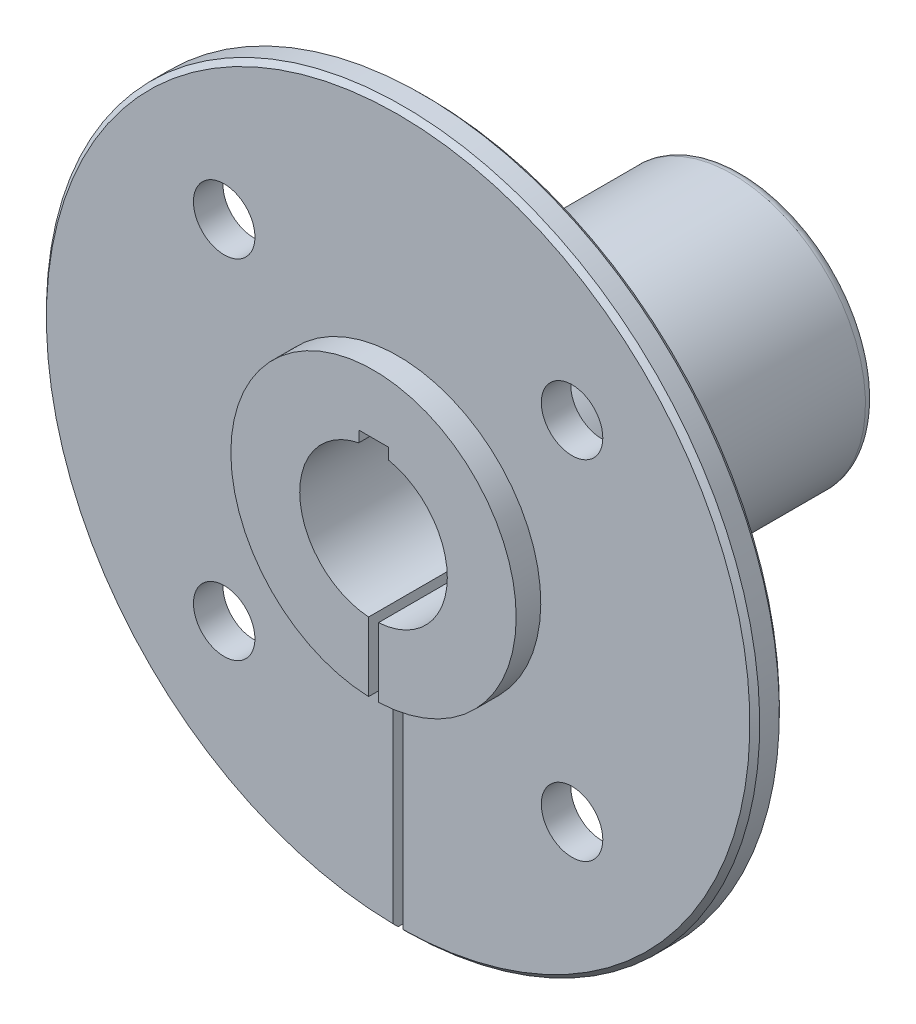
from build123d import *

# Parameters (mm, degrees)
SKIZZE1_R                            = 27
SKIZZE1_R_2                          = 15
LINEAR_AUSTRAGEN1_DEPTH              = 64
SKIZZE2_R                            = 72.5
SKIZZE2_R_2                          = 15
LINEAR_AUSTRAGEN2_DEPTH              = 6
SKIZZE7_R                            = 29
SKIZZE7_R_2                          = 15
LINEAR_AUSTRAGEN3_DEPTH              = 5
VERRUNDUNG1_R                        = 2
SKIZZE8_R                            = 15
SKIZZE8_W                            = 6
SKIZZE8_H                            = 2.25
SCHNITT_LINEAR_AUSTRAGEN1_DEPTH      = 128.033460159
FASE1_SIZE                           = 1
VERRUNDUNG2_R                        = 10
F_12_5_12_5_DURCHMESSER_BOHRUNG1_D   = 12.5
SCHNITT_LINEAR_AUSTRAGEN2_DEPTH      = 128.033460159
SCHNITT_LINEAR_AUSTRAGEN3_REACH      = 129.033
SCHNITT_LINEAR_AUSTRAGEN3_END_RADIUS = 27
SKIZZE12_R                           = 2.75
M5X0_8_GEWINDEKERNLOCH1_D            = 4.2
M5X0_8_GEWINDEKERNLOCH1_DEPTH        = 12.4
M5X0_8_GEWINDEKERNLOCH1_CBORE_D      = 5
M5X0_8_GEWINDEKERNLOCH1_CBORE_DEPTH  = 10
M5X0_8_GEWINDEKERNLOCH1_TIP          = 1.2618073
SCHNITT_LINEAR_AUSTRAGEN4_REACH      = 133.458
SKIZZE15_R                           = 5


with BuildPart() as part:
    # Skizze1 → Linear austragen1 (new body)
    with BuildSketch(Plane.XY):
        Circle(SKIZZE1_R)
        Circle(SKIZZE1_R_2, mode=Mode.SUBTRACT)
    extrude(amount=LINEAR_AUSTRAGEN1_DEPTH)

    # Skizze2 → Linear austragen2 (add)
    with BuildSketch(Plane.XY.offset(64)):
        Circle(SKIZZE2_R)
        Circle(SKIZZE2_R_2, mode=Mode.SUBTRACT)
    extrude(amount=LINEAR_AUSTRAGEN2_DEPTH)

    # Skizze7 → Linear austragen3 (add)
    with BuildSketch(Plane.XY.offset(70)):
        Circle(SKIZZE7_R)
        Circle(SKIZZE7_R_2, mode=Mode.SUBTRACT)
    extrude(amount=LINEAR_AUSTRAGEN3_DEPTH)

    # Verrundung1
    verrundung1_edges = [part.edges().sort_by_distance(p)[0] for p in [
        (-27, 0, 0),
    ]]
    fillet(verrundung1_edges, radius=VERRUNDUNG1_R)

    # Skizze8 → Schnitt-Linear austragen1 (cut, through all)
    with BuildSketch(Plane.XY.offset(75)):
        Circle(SKIZZE8_R)
        with Locations((0, 15.821938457)):
            Rectangle(SKIZZE8_W, SKIZZE8_H)
    extrude(amount=-SCHNITT_LINEAR_AUSTRAGEN1_DEPTH, mode=Mode.SUBTRACT)

    # Fase1
    fase1_edges = [part.edges().sort_by_distance(p)[0] for p in [
        (-72.5, 0, 64),
        (-72.5, 0, 70),
    ]]
    chamfer(fase1_edges, length=FASE1_SIZE)

    # Verrundung2
    verrundung2_edges = [part.edges().sort_by_distance(p)[0] for p in [
        (-27, 0, 64),
    ]]
    fillet(verrundung2_edges, radius=VERRUNDUNG2_R)

    # 12.5 _12.5_ Durchmesser Bohrung1 (through all)
    with Locations(Plane(origin=(-35.355339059, 35.355339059, 70), x_dir=(1, 0, 0), z_dir=(0, 0, 1))):
        with Locations((0, 0), (70.710678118, 0), (70.710678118, -70.710678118), (0, -70.710678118)):
            Hole(F_12_5_12_5_DURCHMESSER_BOHRUNG1_D / 2)

    # Skizze11 → Schnitt-Linear austragen2 (cut, through all)
    with BuildSketch(Plane.XY):
        Polygon((1, -14.617683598), (-1, -14.617683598), (-1, -71.493006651), (-1, -72.598697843), (1, -72.598697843), (1, -71.493006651), align=None)
    extrude(amount=SCHNITT_LINEAR_AUSTRAGEN2_DEPTH, mode=Mode.SUBTRACT)

    # Schnitt-Linear austragen3: up to this cylinder (the profile starts inside it)
    schnitt_linear_austragen3_end = Plane(origin=(0, 0, 27.5), z_dir=(0, 0, -1)) * Cylinder(SCHNITT_LINEAR_AUSTRAGEN3_END_RADIUS, 338.066, mode=Mode.PRIVATE)
    # Skizze12 → Schnitt-Linear austragen3 (cut, up to the surface)
    with BuildSketch(Plane(origin=(0, 0, 0), x_dir=(0, 0, -1), z_dir=(1, 0, 0)), mode=Mode.PRIVATE) as schnitt_linear_austragen3_sk1:
        with Locations((-15, -20.981475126)):
            Circle(SKIZZE12_R)
    schnitt_linear_austragen3_tool1 = extrude(schnitt_linear_austragen3_sk1.sketch, amount=-SCHNITT_LINEAR_AUSTRAGEN3_REACH, mode=Mode.PRIVATE) & schnitt_linear_austragen3_end
    add(schnitt_linear_austragen3_tool1.solids().sort_by_distance((0, -20.981475, 15))[0], mode=Mode.SUBTRACT)
    # Skizze12 → Schnitt-Linear austragen3 (cut, up to the surface)
    with BuildSketch(Plane(origin=(0, 0, 0), x_dir=(0, 0, -1), z_dir=(1, 0, 0)), mode=Mode.PRIVATE) as schnitt_linear_austragen3_sk2:
        with Locations((-40, -20.981475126)):
            Circle(SKIZZE12_R)
    schnitt_linear_austragen3_tool2 = extrude(schnitt_linear_austragen3_sk2.sketch, amount=-SCHNITT_LINEAR_AUSTRAGEN3_REACH, mode=Mode.PRIVATE) & schnitt_linear_austragen3_end
    add(schnitt_linear_austragen3_tool2.solids().sort_by_distance((0, -20.981475, 40))[0], mode=Mode.SUBTRACT)

    # M5x0.8 Gewindekernloch1
    with Locations(Plane(origin=(1, -20.981475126, 40), x_dir=(0, 0, -1), z_dir=(-1, 0, 0))):
        with Locations((0, 0), (25, 0)):
            CounterBoreHole(M5X0_8_GEWINDEKERNLOCH1_D / 2, M5X0_8_GEWINDEKERNLOCH1_CBORE_D / 2, M5X0_8_GEWINDEKERNLOCH1_CBORE_DEPTH, depth=M5X0_8_GEWINDEKERNLOCH1_DEPTH)
            with Locations((0, 0, -(M5X0_8_GEWINDEKERNLOCH1_DEPTH + M5X0_8_GEWINDEKERNLOCH1_TIP / 2))):  # 118° drill point
                Cone(0, M5X0_8_GEWINDEKERNLOCH1_D / 2, M5X0_8_GEWINDEKERNLOCH1_TIP, mode=Mode.SUBTRACT)

    # Skizze15 → Schnitt-Linear austragen4 (cut, up to next)
    with BuildSketch(Plane(origin=(-7.5, 0, 0), x_dir=(0, 0, -1), z_dir=(1, 0, 0)), mode=Mode.PRIVATE) as schnitt_linear_austragen4_sk1:
        with Locations((-15, -20.981475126)):
            Circle(SKIZZE15_R)
    schnitt_linear_austragen4_tool1 = extrude(schnitt_linear_austragen4_sk1.sketch, amount=-SCHNITT_LINEAR_AUSTRAGEN4_REACH, mode=Mode.PRIVATE) & part.part
    # Skizze15 → Schnitt-Linear austragen4 (cut, up to next)
    with BuildSketch(Plane(origin=(-7.5, 0, 0), x_dir=(0, 0, -1), z_dir=(1, 0, 0)), mode=Mode.PRIVATE) as schnitt_linear_austragen4_sk2:
        with Locations((-40, -20.981475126)):
            Circle(SKIZZE15_R)
    schnitt_linear_austragen4_tool2 = extrude(schnitt_linear_austragen4_sk2.sketch, amount=-SCHNITT_LINEAR_AUSTRAGEN4_REACH, mode=Mode.PRIVATE) & part.part
    add(schnitt_linear_austragen4_tool1.solids().sort_by_distance((-7.5, -20.981475, 15))[0], mode=Mode.SUBTRACT)
    add(schnitt_linear_austragen4_tool2.solids().sort_by_distance((-7.5, -20.981475, 40))[0], mode=Mode.SUBTRACT)


solid = part.part
